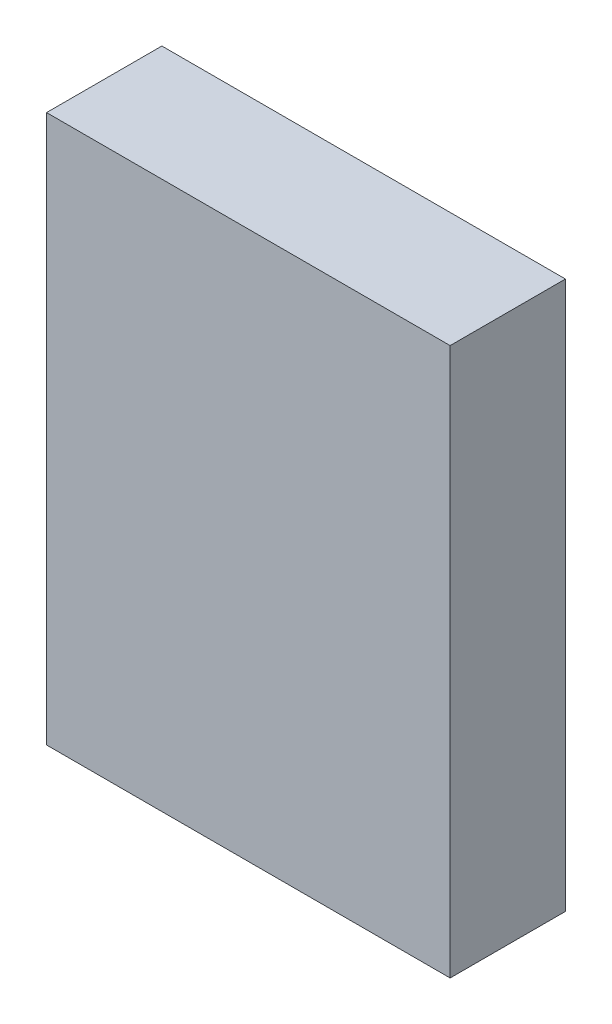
ISO-10303-21;
HEADER;
FILE_DESCRIPTION(('STEP AP214'),'2;1');
FILE_NAME('part.step','',(''),(''),'','','');
FILE_SCHEMA(('AUTOMOTIVE_DESIGN { 1 0 10303 214 1 1 1 1 }'));
ENDSEC;
DATA;
#1=APPLICATION_CONTEXT('core data for automotive mechanical design processes');
#2=APPLICATION_PROTOCOL_DEFINITION('international standard','automotive_design',2000,#1);
#3=PRODUCT_CONTEXT('',#1,'mechanical');
#4=PRODUCT('Part','Part','',(#3));
#5=PRODUCT_RELATED_PRODUCT_CATEGORY('part','',(#4));
#6=PRODUCT_DEFINITION_FORMATION('','',#4);
#7=PRODUCT_DEFINITION_CONTEXT('part definition',#1,'design');
#8=PRODUCT_DEFINITION('design','',#6,#7);
#9=PRODUCT_DEFINITION_SHAPE('','',#8);
#10=(LENGTH_UNIT() NAMED_UNIT(*) SI_UNIT(.MILLI.,.METRE.));
#11=(NAMED_UNIT(*) PLANE_ANGLE_UNIT() SI_UNIT($,.RADIAN.));
#12=(NAMED_UNIT(*) SI_UNIT($,.STERADIAN.) SOLID_ANGLE_UNIT());
#13=UNCERTAINTY_MEASURE_WITH_UNIT(LENGTH_MEASURE(1.E-05),#10,'distance_accuracy_value','');
#14=(GEOMETRIC_REPRESENTATION_CONTEXT(3) GLOBAL_UNCERTAINTY_ASSIGNED_CONTEXT((#13)) GLOBAL_UNIT_ASSIGNED_CONTEXT((#10,
#11,#12)) REPRESENTATION_CONTEXT('',''));
#15=CARTESIAN_POINT('',(0.,0.,0.));
#16=DIRECTION('',(0.,0.,1.));
#17=DIRECTION('',(1.,0.,0.));
#18=AXIS2_PLACEMENT_3D('',#15,#16,#17);
#19=CARTESIAN_POINT('',(17.5,-23.75,10.));
#20=DIRECTION('',(-1.,0.,0.));
#21=DIRECTION('',(0.,0.,1.));
#22=AXIS2_PLACEMENT_3D('',#19,#20,#21);
#23=PLANE('',#22);
#24=DIRECTION('',(0.,1.,0.));
#25=VECTOR('',#24,1.);
#26=CARTESIAN_POINT('',(17.5,-23.75,0.));
#27=LINE('',#26,#25);
#28=CARTESIAN_POINT('',(17.5,-23.75,0.));
#29=VERTEX_POINT('',#28);
#30=CARTESIAN_POINT('',(17.5,23.75,0.));
#31=VERTEX_POINT('',#30);
#32=EDGE_CURVE('E100',#29,#31,#27,.T.);
#33=ORIENTED_EDGE('',*,*,#32,.T.);
#34=DIRECTION('',(0.,0.,-1.));
#35=VECTOR('',#34,1.);
#36=CARTESIAN_POINT('',(17.5,23.75,10.));
#37=LINE('',#36,#35);
#38=CARTESIAN_POINT('',(17.5,23.75,10.));
#39=VERTEX_POINT('',#38);
#40=EDGE_CURVE('E11',#39,#31,#37,.T.);
#41=ORIENTED_EDGE('',*,*,#40,.F.);
#42=DIRECTION('',(0.,1.,0.));
#43=VECTOR('',#42,1.);
#44=CARTESIAN_POINT('',(17.5,-23.75,10.));
#45=LINE('',#44,#43);
#46=CARTESIAN_POINT('',(17.5,-23.75,10.));
#47=VERTEX_POINT('',#46);
#48=EDGE_CURVE('E88',#47,#39,#45,.T.);
#49=ORIENTED_EDGE('',*,*,#48,.F.);
#50=DIRECTION('',(0.,0.,-1.));
#51=VECTOR('',#50,1.);
#52=CARTESIAN_POINT('',(17.5,-23.75,10.));
#53=LINE('',#52,#51);
#54=EDGE_CURVE('E96',#47,#29,#53,.T.);
#55=ORIENTED_EDGE('',*,*,#54,.T.);
#56=EDGE_LOOP('',(#33,#41,#49,#55));
#57=FACE_BOUND('',#56,.T.);
#58=ADVANCED_FACE('F37',(#57),#23,.F.);
#59=CARTESIAN_POINT('',(-17.5,23.75,10.));
#60=DIRECTION('',(0.,-1.,0.));
#61=DIRECTION('',(0.,0.,-1.));
#62=AXIS2_PLACEMENT_3D('',#59,#60,#61);
#63=PLANE('',#62);
#64=DIRECTION('',(-1.,0.,0.));
#65=VECTOR('',#64,1.);
#66=CARTESIAN_POINT('',(-17.5,23.75,0.));
#67=LINE('',#66,#65);
#68=CARTESIAN_POINT('',(-17.5,23.75,0.));
#69=VERTEX_POINT('',#68);
#70=EDGE_CURVE('E92',#31,#69,#67,.T.);
#71=ORIENTED_EDGE('',*,*,#70,.T.);
#72=DIRECTION('',(0.,0.,-1.));
#73=VECTOR('',#72,1.);
#74=CARTESIAN_POINT('',(-17.5,23.75,10.));
#75=LINE('',#74,#73);
#76=CARTESIAN_POINT('',(-17.5,23.75,10.));
#77=VERTEX_POINT('',#76);
#78=EDGE_CURVE('E45',#77,#69,#75,.T.);
#79=ORIENTED_EDGE('',*,*,#78,.F.);
#80=DIRECTION('',(-1.,0.,0.));
#81=VECTOR('',#80,1.);
#82=CARTESIAN_POINT('',(-17.5,23.75,10.));
#83=LINE('',#82,#81);
#84=EDGE_CURVE('E83',#39,#77,#83,.T.);
#85=ORIENTED_EDGE('',*,*,#84,.F.);
#86=ORIENTED_EDGE('',*,*,#40,.T.);
#87=EDGE_LOOP('',(#71,#79,#85,#86));
#88=FACE_BOUND('',#87,.T.);
#89=ADVANCED_FACE('F91',(#88),#63,.F.);
#90=CARTESIAN_POINT('',(-17.5,-23.75,10.));
#91=DIRECTION('',(1.,0.,0.));
#92=DIRECTION('',(0.,0.,-1.));
#93=AXIS2_PLACEMENT_3D('',#90,#91,#92);
#94=PLANE('',#93);
#95=DIRECTION('',(0.,-1.,0.));
#96=VECTOR('',#95,1.);
#97=CARTESIAN_POINT('',(-17.5,-23.75,0.));
#98=LINE('',#97,#96);
#99=CARTESIAN_POINT('',(-17.5,-23.75,0.));
#100=VERTEX_POINT('',#99);
#101=EDGE_CURVE('E70',#69,#100,#98,.T.);
#102=ORIENTED_EDGE('',*,*,#101,.T.);
#103=DIRECTION('',(0.,0.,-1.));
#104=VECTOR('',#103,1.);
#105=CARTESIAN_POINT('',(-17.5,-23.75,10.));
#106=LINE('',#105,#104);
#107=CARTESIAN_POINT('',(-17.5,-23.75,10.));
#108=VERTEX_POINT('',#107);
#109=EDGE_CURVE('E93',#108,#100,#106,.T.);
#110=ORIENTED_EDGE('',*,*,#109,.F.);
#111=DIRECTION('',(0.,-1.,0.));
#112=VECTOR('',#111,1.);
#113=CARTESIAN_POINT('',(-17.5,-23.75,10.));
#114=LINE('',#113,#112);
#115=EDGE_CURVE('E86',#77,#108,#114,.T.);
#116=ORIENTED_EDGE('',*,*,#115,.F.);
#117=ORIENTED_EDGE('',*,*,#78,.T.);
#118=EDGE_LOOP('',(#102,#110,#116,#117));
#119=FACE_BOUND('',#118,.T.);
#120=ADVANCED_FACE('F94',(#119),#94,.F.);
#121=CARTESIAN_POINT('',(-17.5,-23.75,10.));
#122=DIRECTION('',(0.,1.,0.));
#123=DIRECTION('',(0.,0.,1.));
#124=AXIS2_PLACEMENT_3D('',#121,#122,#123);
#125=PLANE('',#124);
#126=DIRECTION('',(1.,0.,0.));
#127=VECTOR('',#126,1.);
#128=CARTESIAN_POINT('',(-17.5,-23.75,0.));
#129=LINE('',#128,#127);
#130=EDGE_CURVE('E76',#100,#29,#129,.T.);
#131=ORIENTED_EDGE('',*,*,#130,.T.);
#132=ORIENTED_EDGE('',*,*,#54,.F.);
#133=DIRECTION('',(1.,0.,0.));
#134=VECTOR('',#133,1.);
#135=CARTESIAN_POINT('',(-17.5,-23.75,10.));
#136=LINE('',#135,#134);
#137=EDGE_CURVE('E53',#108,#47,#136,.T.);
#138=ORIENTED_EDGE('',*,*,#137,.F.);
#139=ORIENTED_EDGE('',*,*,#109,.T.);
#140=EDGE_LOOP('',(#131,#132,#138,#139));
#141=FACE_BOUND('',#140,.T.);
#142=ADVANCED_FACE('F107',(#141),#125,.F.);
#143=CARTESIAN_POINT('',(0.,0.,10.));
#144=DIRECTION('',(0.,0.,-1.));
#145=DIRECTION('',(-1.,0.,0.));
#146=AXIS2_PLACEMENT_3D('',#143,#144,#145);
#147=PLANE('',#146);
#148=ORIENTED_EDGE('',*,*,#48,.T.);
#149=ORIENTED_EDGE('',*,*,#84,.T.);
#150=ORIENTED_EDGE('',*,*,#115,.T.);
#151=ORIENTED_EDGE('',*,*,#137,.T.);
#152=EDGE_LOOP('',(#148,#149,#150,#151));
#153=FACE_BOUND('',#152,.T.);
#154=ADVANCED_FACE('F84',(#153),#147,.F.);
#155=CARTESIAN_POINT('',(0.,0.,0.));
#156=DIRECTION('',(0.,0.,-1.));
#157=DIRECTION('',(-1.,0.,0.));
#158=AXIS2_PLACEMENT_3D('',#155,#156,#157);
#159=PLANE('',#158);
#160=ORIENTED_EDGE('',*,*,#32,.F.);
#161=ORIENTED_EDGE('',*,*,#130,.F.);
#162=ORIENTED_EDGE('',*,*,#101,.F.);
#163=ORIENTED_EDGE('',*,*,#70,.F.);
#164=EDGE_LOOP('',(#160,#161,#162,#163));
#165=FACE_BOUND('',#164,.T.);
#166=ADVANCED_FACE('F110',(#165),#159,.T.);
#167=CLOSED_SHELL('',(#58,#89,#120,#142,#154,#166));
#168=MANIFOLD_SOLID_BREP('B2',#167);
#169=ADVANCED_BREP_SHAPE_REPRESENTATION('',(#18,#168),#14);
#170=SHAPE_DEFINITION_REPRESENTATION(#9,#169);
ENDSEC;
END-ISO-10303-21;
